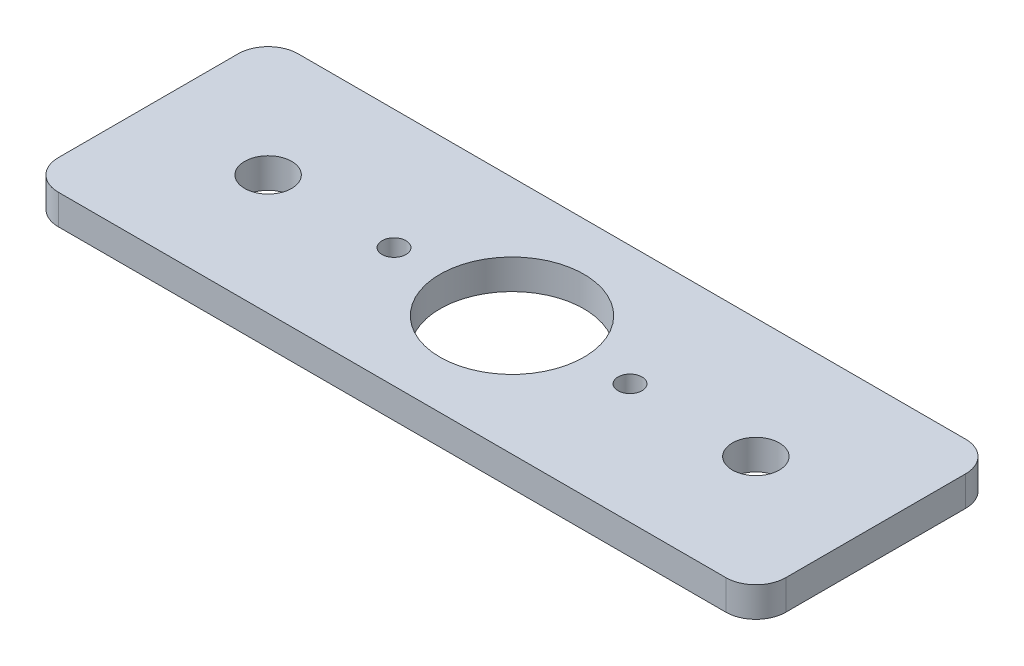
ISO-10303-21;
HEADER;
FILE_DESCRIPTION(('STEP AP214'),'2;1');
FILE_NAME('part.step','',(''),(''),'','','');
FILE_SCHEMA(('AUTOMOTIVE_DESIGN { 1 0 10303 214 1 1 1 1 }'));
ENDSEC;
DATA;
#1=APPLICATION_CONTEXT('core data for automotive mechanical design processes');
#2=APPLICATION_PROTOCOL_DEFINITION('international standard','automotive_design',2000,#1);
#3=PRODUCT_CONTEXT('',#1,'mechanical');
#4=PRODUCT('Part','Part','',(#3));
#5=PRODUCT_RELATED_PRODUCT_CATEGORY('part','',(#4));
#6=PRODUCT_DEFINITION_FORMATION('','',#4);
#7=PRODUCT_DEFINITION_CONTEXT('part definition',#1,'design');
#8=PRODUCT_DEFINITION('design','',#6,#7);
#9=PRODUCT_DEFINITION_SHAPE('','',#8);
#10=(LENGTH_UNIT() NAMED_UNIT(*) SI_UNIT(.MILLI.,.METRE.));
#11=(NAMED_UNIT(*) PLANE_ANGLE_UNIT() SI_UNIT($,.RADIAN.));
#12=(NAMED_UNIT(*) SI_UNIT($,.STERADIAN.) SOLID_ANGLE_UNIT());
#13=UNCERTAINTY_MEASURE_WITH_UNIT(LENGTH_MEASURE(1.E-05),#10,'distance_accuracy_value','');
#14=(GEOMETRIC_REPRESENTATION_CONTEXT(3) GLOBAL_UNCERTAINTY_ASSIGNED_CONTEXT((#13)) GLOBAL_UNIT_ASSIGNED_CONTEXT((#10,
#11,#12)) REPRESENTATION_CONTEXT('',''));
#15=CARTESIAN_POINT('',(0.,0.,0.));
#16=DIRECTION('',(0.,0.,1.));
#17=DIRECTION('',(1.,0.,0.));
#18=AXIS2_PLACEMENT_3D('',#15,#16,#17);
#19=CARTESIAN_POINT('',(0.,3.175,0.));
#20=DIRECTION('',(0.,-1.,0.));
#21=DIRECTION('',(0.,0.,-1.));
#22=AXIS2_PLACEMENT_3D('',#19,#20,#21);
#23=PLANE('',#22);
#24=DIRECTION('',(-1.,0.,0.));
#25=VECTOR('',#24,1.);
#26=CARTESIAN_POINT('',(0.,3.175,-25.4));
#27=LINE('',#26,#25);
#28=CARTESIAN_POINT('',(73.8886,3.175,-25.4));
#29=VERTEX_POINT('',#28);
#30=CARTESIAN_POINT('',(3.175,3.175,-25.4));
#31=VERTEX_POINT('',#30);
#32=EDGE_CURVE('E137',#29,#31,#27,.T.);
#33=ORIENTED_EDGE('',*,*,#32,.T.);
#34=CARTESIAN_POINT('',(3.175,3.175,-22.225));
#35=DIRECTION('',(0.,-1.,0.));
#36=DIRECTION('',(0.,0.,-1.));
#37=AXIS2_PLACEMENT_3D('',#34,#35,#36);
#38=CIRCLE('',#37,3.175);
#39=CARTESIAN_POINT('',(0.,3.175,-22.225));
#40=VERTEX_POINT('',#39);
#41=EDGE_CURVE('E156',#31,#40,#38,.F.);
#42=ORIENTED_EDGE('',*,*,#41,.T.);
#43=DIRECTION('',(0.,0.,1.));
#44=VECTOR('',#43,1.);
#45=CARTESIAN_POINT('',(0.,3.175,0.));
#46=LINE('',#45,#44);
#47=CARTESIAN_POINT('',(0.,3.175,-3.175));
#48=VERTEX_POINT('',#47);
#49=EDGE_CURVE('E120',#40,#48,#46,.T.);
#50=ORIENTED_EDGE('',*,*,#49,.T.);
#51=CARTESIAN_POINT('',(3.175,3.175,-3.175));
#52=DIRECTION('',(0.,-1.,0.));
#53=DIRECTION('',(0.,0.,-1.));
#54=AXIS2_PLACEMENT_3D('',#51,#52,#53);
#55=CIRCLE('',#54,3.175);
#56=CARTESIAN_POINT('',(3.175,3.175,0.));
#57=VERTEX_POINT('',#56);
#58=EDGE_CURVE('E151',#48,#57,#55,.F.);
#59=ORIENTED_EDGE('',*,*,#58,.T.);
#60=DIRECTION('',(1.,0.,0.));
#61=VECTOR('',#60,1.);
#62=CARTESIAN_POINT('',(0.,3.175,0.));
#63=LINE('',#62,#61);
#64=CARTESIAN_POINT('',(73.8886,3.175,0.));
#65=VERTEX_POINT('',#64);
#66=EDGE_CURVE('E167',#57,#65,#63,.T.);
#67=ORIENTED_EDGE('',*,*,#66,.T.);
#68=CARTESIAN_POINT('',(73.8886,3.175,-3.175));
#69=DIRECTION('',(0.,-1.,0.));
#70=DIRECTION('',(0.,0.,-1.));
#71=AXIS2_PLACEMENT_3D('',#68,#69,#70);
#72=CIRCLE('',#71,3.175);
#73=CARTESIAN_POINT('',(77.0636,3.175,-3.175));
#74=VERTEX_POINT('',#73);
#75=EDGE_CURVE('E56',#65,#74,#72,.F.);
#76=ORIENTED_EDGE('',*,*,#75,.T.);
#77=DIRECTION('',(0.,0.,-1.));
#78=VECTOR('',#77,1.);
#79=CARTESIAN_POINT('',(77.0636,3.175,0.));
#80=LINE('',#79,#78);
#81=CARTESIAN_POINT('',(77.0636,3.175,-22.225));
#82=VERTEX_POINT('',#81);
#83=EDGE_CURVE('E175',#74,#82,#80,.T.);
#84=ORIENTED_EDGE('',*,*,#83,.T.);
#85=CARTESIAN_POINT('',(73.8886,3.175,-22.225));
#86=DIRECTION('',(0.,-1.,0.));
#87=DIRECTION('',(0.,0.,-1.));
#88=AXIS2_PLACEMENT_3D('',#85,#86,#87);
#89=CIRCLE('',#88,3.175);
#90=EDGE_CURVE('E154',#82,#29,#89,.F.);
#91=ORIENTED_EDGE('',*,*,#90,.T.);
#92=EDGE_LOOP('',(#33,#42,#50,#59,#67,#76,#84,#91));
#93=FACE_BOUND('',#92,.T.);
#94=CARTESIAN_POINT('',(38.5318,3.175,-12.7));
#95=DIRECTION('',(0.,1.,0.));
#96=DIRECTION('',(0.,0.,1.));
#97=AXIS2_PLACEMENT_3D('',#94,#95,#96);
#98=CIRCLE('',#97,7.62);
#99=CARTESIAN_POINT('',(38.5318,3.175,-5.08));
#100=VERTEX_POINT('',#99);
#101=EDGE_CURVE('E128',#100,#100,#98,.T.);
#102=ORIENTED_EDGE('',*,*,#101,.F.);
#103=EDGE_LOOP('',(#102));
#104=FACE_BOUND('',#103,.T.);
#105=CARTESIAN_POINT('',(51.0318,3.175,-12.7));
#106=DIRECTION('',(0.,1.,0.));
#107=DIRECTION('',(0.,0.,1.));
#108=AXIS2_PLACEMENT_3D('',#105,#106,#107);
#109=CIRCLE('',#108,1.27);
#110=CARTESIAN_POINT('',(51.0318,3.175,-11.43));
#111=VERTEX_POINT('',#110);
#112=EDGE_CURVE('E182',#111,#111,#109,.T.);
#113=ORIENTED_EDGE('',*,*,#112,.F.);
#114=EDGE_LOOP('',(#113));
#115=FACE_BOUND('',#114,.T.);
#116=CARTESIAN_POINT('',(26.0318,3.175,-12.7));
#117=DIRECTION('',(0.,1.,0.));
#118=DIRECTION('',(0.,0.,1.));
#119=AXIS2_PLACEMENT_3D('',#116,#117,#118);
#120=CIRCLE('',#119,1.27);
#121=CARTESIAN_POINT('',(26.0318,3.175,-11.43));
#122=VERTEX_POINT('',#121);
#123=EDGE_CURVE('E187',#122,#122,#120,.T.);
#124=ORIENTED_EDGE('',*,*,#123,.F.);
#125=EDGE_LOOP('',(#124));
#126=FACE_BOUND('',#125,.T.);
#127=CARTESIAN_POINT('',(64.3636,3.175,-12.7));
#128=DIRECTION('',(0.,1.,0.));
#129=DIRECTION('',(0.,0.,1.));
#130=AXIS2_PLACEMENT_3D('',#127,#128,#129);
#131=CIRCLE('',#130,2.4892);
#132=CARTESIAN_POINT('',(64.3636,3.175,-10.2108));
#133=VERTEX_POINT('',#132);
#134=EDGE_CURVE('E193',#133,#133,#131,.T.);
#135=ORIENTED_EDGE('',*,*,#134,.F.);
#136=EDGE_LOOP('',(#135));
#137=FACE_BOUND('',#136,.T.);
#138=CARTESIAN_POINT('',(12.7,3.175,-12.7));
#139=DIRECTION('',(0.,1.,0.));
#140=DIRECTION('',(0.,0.,1.));
#141=AXIS2_PLACEMENT_3D('',#138,#139,#140);
#142=CIRCLE('',#141,2.4892);
#143=CARTESIAN_POINT('',(12.7,3.175,-10.2108));
#144=VERTEX_POINT('',#143);
#145=EDGE_CURVE('E199',#144,#144,#142,.T.);
#146=ORIENTED_EDGE('',*,*,#145,.F.);
#147=EDGE_LOOP('',(#146));
#148=FACE_BOUND('',#147,.T.);
#149=ADVANCED_FACE('F34',(#93,#104,#115,#126,#137,#148),#23,.F.);
#150=CARTESIAN_POINT('',(0.,0.,0.));
#151=DIRECTION('',(0.,-1.,0.));
#152=DIRECTION('',(0.,0.,-1.));
#153=AXIS2_PLACEMENT_3D('',#150,#151,#152);
#154=PLANE('',#153);
#155=CARTESIAN_POINT('',(64.3636,0.,-12.7));
#156=DIRECTION('',(0.,1.,0.));
#157=DIRECTION('',(0.,0.,1.));
#158=AXIS2_PLACEMENT_3D('',#155,#156,#157);
#159=CIRCLE('',#158,2.4892);
#160=CARTESIAN_POINT('',(64.3636,0.,-10.2108));
#161=VERTEX_POINT('',#160);
#162=EDGE_CURVE('E196',#161,#161,#159,.T.);
#163=ORIENTED_EDGE('',*,*,#162,.T.);
#164=EDGE_LOOP('',(#163));
#165=FACE_BOUND('',#164,.T.);
#166=CARTESIAN_POINT('',(51.0318,0.,-12.7));
#167=DIRECTION('',(0.,1.,0.));
#168=DIRECTION('',(0.,0.,1.));
#169=AXIS2_PLACEMENT_3D('',#166,#167,#168);
#170=CIRCLE('',#169,1.27);
#171=CARTESIAN_POINT('',(51.0318,0.,-11.43));
#172=VERTEX_POINT('',#171);
#173=EDGE_CURVE('E184',#172,#172,#170,.T.);
#174=ORIENTED_EDGE('',*,*,#173,.T.);
#175=EDGE_LOOP('',(#174));
#176=FACE_BOUND('',#175,.T.);
#177=DIRECTION('',(0.,0.,1.));
#178=VECTOR('',#177,1.);
#179=CARTESIAN_POINT('',(0.,0.,0.));
#180=LINE('',#179,#178);
#181=CARTESIAN_POINT('',(0.,0.,-22.225));
#182=VERTEX_POINT('',#181);
#183=CARTESIAN_POINT('',(0.,0.,-3.175));
#184=VERTEX_POINT('',#183);
#185=EDGE_CURVE('E117',#182,#184,#180,.T.);
#186=ORIENTED_EDGE('',*,*,#185,.F.);
#187=CARTESIAN_POINT('',(3.175,0.,-22.225));
#188=DIRECTION('',(0.,-1.,0.));
#189=DIRECTION('',(0.,0.,-1.));
#190=AXIS2_PLACEMENT_3D('',#187,#188,#189);
#191=CIRCLE('',#190,3.175);
#192=CARTESIAN_POINT('',(3.175,0.,-25.4));
#193=VERTEX_POINT('',#192);
#194=EDGE_CURVE('E100',#182,#193,#191,.T.);
#195=ORIENTED_EDGE('',*,*,#194,.T.);
#196=DIRECTION('',(-1.,0.,0.));
#197=VECTOR('',#196,1.);
#198=CARTESIAN_POINT('',(0.,0.,-25.4));
#199=LINE('',#198,#197);
#200=CARTESIAN_POINT('',(73.8886,0.,-25.4));
#201=VERTEX_POINT('',#200);
#202=EDGE_CURVE('E141',#201,#193,#199,.T.);
#203=ORIENTED_EDGE('',*,*,#202,.F.);
#204=CARTESIAN_POINT('',(73.8886,0.,-22.225));
#205=DIRECTION('',(0.,-1.,0.));
#206=DIRECTION('',(0.,0.,-1.));
#207=AXIS2_PLACEMENT_3D('',#204,#205,#206);
#208=CIRCLE('',#207,3.175);
#209=CARTESIAN_POINT('',(77.0636,0.,-22.225));
#210=VERTEX_POINT('',#209);
#211=EDGE_CURVE('E111',#201,#210,#208,.T.);
#212=ORIENTED_EDGE('',*,*,#211,.T.);
#213=DIRECTION('',(0.,0.,-1.));
#214=VECTOR('',#213,1.);
#215=CARTESIAN_POINT('',(77.0636,0.,0.));
#216=LINE('',#215,#214);
#217=CARTESIAN_POINT('',(77.0636,0.,-3.175));
#218=VERTEX_POINT('',#217);
#219=EDGE_CURVE('E131',#218,#210,#216,.T.);
#220=ORIENTED_EDGE('',*,*,#219,.F.);
#221=CARTESIAN_POINT('',(73.8886,0.,-3.175));
#222=DIRECTION('',(0.,-1.,0.));
#223=DIRECTION('',(0.,0.,-1.));
#224=AXIS2_PLACEMENT_3D('',#221,#222,#223);
#225=CIRCLE('',#224,3.175);
#226=CARTESIAN_POINT('',(73.8886,0.,0.));
#227=VERTEX_POINT('',#226);
#228=EDGE_CURVE('E145',#218,#227,#225,.T.);
#229=ORIENTED_EDGE('',*,*,#228,.T.);
#230=DIRECTION('',(1.,0.,0.));
#231=VECTOR('',#230,1.);
#232=CARTESIAN_POINT('',(0.,0.,0.));
#233=LINE('',#232,#231);
#234=CARTESIAN_POINT('',(3.175,0.,0.));
#235=VERTEX_POINT('',#234);
#236=EDGE_CURVE('E127',#235,#227,#233,.T.);
#237=ORIENTED_EDGE('',*,*,#236,.F.);
#238=CARTESIAN_POINT('',(3.175,0.,-3.175));
#239=DIRECTION('',(0.,-1.,0.));
#240=DIRECTION('',(0.,0.,-1.));
#241=AXIS2_PLACEMENT_3D('',#238,#239,#240);
#242=CIRCLE('',#241,3.175);
#243=EDGE_CURVE('E121',#235,#184,#242,.T.);
#244=ORIENTED_EDGE('',*,*,#243,.T.);
#245=EDGE_LOOP('',(#186,#195,#203,#212,#220,#229,#237,#244));
#246=FACE_BOUND('',#245,.T.);
#247=CARTESIAN_POINT('',(38.5318,0.,-12.7));
#248=DIRECTION('',(0.,1.,0.));
#249=DIRECTION('',(0.,0.,1.));
#250=AXIS2_PLACEMENT_3D('',#247,#248,#249);
#251=CIRCLE('',#250,7.62);
#252=CARTESIAN_POINT('',(38.5318,0.,-5.08));
#253=VERTEX_POINT('',#252);
#254=EDGE_CURVE('E134',#253,#253,#251,.T.);
#255=ORIENTED_EDGE('',*,*,#254,.T.);
#256=EDGE_LOOP('',(#255));
#257=FACE_BOUND('',#256,.T.);
#258=CARTESIAN_POINT('',(26.0318,0.,-12.7));
#259=DIRECTION('',(0.,1.,0.));
#260=DIRECTION('',(0.,0.,1.));
#261=AXIS2_PLACEMENT_3D('',#258,#259,#260);
#262=CIRCLE('',#261,1.27);
#263=CARTESIAN_POINT('',(26.0318,0.,-11.43));
#264=VERTEX_POINT('',#263);
#265=EDGE_CURVE('E190',#264,#264,#262,.T.);
#266=ORIENTED_EDGE('',*,*,#265,.T.);
#267=EDGE_LOOP('',(#266));
#268=FACE_BOUND('',#267,.T.);
#269=CARTESIAN_POINT('',(12.7,0.,-12.7));
#270=DIRECTION('',(0.,1.,0.));
#271=DIRECTION('',(0.,0.,1.));
#272=AXIS2_PLACEMENT_3D('',#269,#270,#271);
#273=CIRCLE('',#272,2.4892);
#274=CARTESIAN_POINT('',(12.7,0.,-10.2108));
#275=VERTEX_POINT('',#274);
#276=EDGE_CURVE('E202',#275,#275,#273,.T.);
#277=ORIENTED_EDGE('',*,*,#276,.T.);
#278=EDGE_LOOP('',(#277));
#279=FACE_BOUND('',#278,.T.);
#280=ADVANCED_FACE('F124',(#165,#176,#246,#257,#268,#279),#154,.T.);
#281=CARTESIAN_POINT('',(0.,3.175,0.));
#282=DIRECTION('',(1.,0.,0.));
#283=DIRECTION('',(0.,0.,-1.));
#284=AXIS2_PLACEMENT_3D('',#281,#282,#283);
#285=PLANE('',#284);
#286=ORIENTED_EDGE('',*,*,#49,.F.);
#287=DIRECTION('',(0.,-1.,0.));
#288=VECTOR('',#287,1.);
#289=CARTESIAN_POINT('',(0.,3.175,-22.225));
#290=LINE('',#289,#288);
#291=EDGE_CURVE('E104',#40,#182,#290,.T.);
#292=ORIENTED_EDGE('',*,*,#291,.T.);
#293=ORIENTED_EDGE('',*,*,#185,.T.);
#294=DIRECTION('',(0.,-1.,0.));
#295=VECTOR('',#294,1.);
#296=CARTESIAN_POINT('',(0.,3.175,-3.175));
#297=LINE('',#296,#295);
#298=EDGE_CURVE('E122',#184,#48,#297,.F.);
#299=ORIENTED_EDGE('',*,*,#298,.T.);
#300=EDGE_LOOP('',(#286,#292,#293,#299));
#301=FACE_BOUND('',#300,.T.);
#302=ADVANCED_FACE('F116',(#301),#285,.F.);
#303=CARTESIAN_POINT('',(0.,3.175,0.));
#304=DIRECTION('',(0.,0.,-1.));
#305=DIRECTION('',(-1.,0.,0.));
#306=AXIS2_PLACEMENT_3D('',#303,#304,#305);
#307=PLANE('',#306);
#308=ORIENTED_EDGE('',*,*,#236,.T.);
#309=DIRECTION('',(0.,-1.,0.));
#310=VECTOR('',#309,1.);
#311=CARTESIAN_POINT('',(73.8886,3.175,0.));
#312=LINE('',#311,#310);
#313=EDGE_CURVE('E11',#227,#65,#312,.F.);
#314=ORIENTED_EDGE('',*,*,#313,.T.);
#315=ORIENTED_EDGE('',*,*,#66,.F.);
#316=DIRECTION('',(0.,-1.,0.));
#317=VECTOR('',#316,1.);
#318=CARTESIAN_POINT('',(3.175,3.175,0.));
#319=LINE('',#318,#317);
#320=EDGE_CURVE('E42',#57,#235,#319,.T.);
#321=ORIENTED_EDGE('',*,*,#320,.T.);
#322=EDGE_LOOP('',(#308,#314,#315,#321));
#323=FACE_BOUND('',#322,.T.);
#324=ADVANCED_FACE('F165',(#323),#307,.F.);
#325=CARTESIAN_POINT('',(77.0636,3.175,0.));
#326=DIRECTION('',(-1.,0.,0.));
#327=DIRECTION('',(0.,0.,1.));
#328=AXIS2_PLACEMENT_3D('',#325,#326,#327);
#329=PLANE('',#328);
#330=ORIENTED_EDGE('',*,*,#219,.T.);
#331=DIRECTION('',(0.,-1.,0.));
#332=VECTOR('',#331,1.);
#333=CARTESIAN_POINT('',(77.0636,3.175,-22.225));
#334=LINE('',#333,#332);
#335=EDGE_CURVE('E49',#210,#82,#334,.F.);
#336=ORIENTED_EDGE('',*,*,#335,.T.);
#337=ORIENTED_EDGE('',*,*,#83,.F.);
#338=DIRECTION('',(0.,-1.,0.));
#339=VECTOR('',#338,1.);
#340=CARTESIAN_POINT('',(77.0636,3.175,-3.175));
#341=LINE('',#340,#339);
#342=EDGE_CURVE('E158',#74,#218,#341,.T.);
#343=ORIENTED_EDGE('',*,*,#342,.T.);
#344=EDGE_LOOP('',(#330,#336,#337,#343));
#345=FACE_BOUND('',#344,.T.);
#346=ADVANCED_FACE('F174',(#345),#329,.F.);
#347=CARTESIAN_POINT('',(0.,3.175,-25.4));
#348=DIRECTION('',(0.,0.,1.));
#349=DIRECTION('',(1.,0.,0.));
#350=AXIS2_PLACEMENT_3D('',#347,#348,#349);
#351=PLANE('',#350);
#352=ORIENTED_EDGE('',*,*,#202,.T.);
#353=DIRECTION('',(0.,-1.,0.));
#354=VECTOR('',#353,1.);
#355=CARTESIAN_POINT('',(3.175,3.175,-25.4));
#356=LINE('',#355,#354);
#357=EDGE_CURVE('E105',#193,#31,#356,.F.);
#358=ORIENTED_EDGE('',*,*,#357,.T.);
#359=ORIENTED_EDGE('',*,*,#32,.F.);
#360=DIRECTION('',(0.,-1.,0.));
#361=VECTOR('',#360,1.);
#362=CARTESIAN_POINT('',(73.8886,3.175,-25.4));
#363=LINE('',#362,#361);
#364=EDGE_CURVE('E110',#29,#201,#363,.T.);
#365=ORIENTED_EDGE('',*,*,#364,.T.);
#366=EDGE_LOOP('',(#352,#358,#359,#365));
#367=FACE_BOUND('',#366,.T.);
#368=ADVANCED_FACE('F223',(#367),#351,.F.);
#369=CARTESIAN_POINT('',(38.5318,3.175,-12.7));
#370=DIRECTION('',(0.,-1.,0.));
#371=DIRECTION('',(0.,0.,-1.));
#372=AXIS2_PLACEMENT_3D('',#369,#370,#371);
#373=CYLINDRICAL_SURFACE('',#372,7.62);
#374=ORIENTED_EDGE('',*,*,#101,.T.);
#375=EDGE_LOOP('',(#374));
#376=FACE_BOUND('',#375,.T.);
#377=ORIENTED_EDGE('',*,*,#254,.F.);
#378=EDGE_LOOP('',(#377));
#379=FACE_BOUND('',#378,.T.);
#380=ADVANCED_FACE('F220',(#376,#379),#373,.F.);
#381=CARTESIAN_POINT('',(51.0318,3.175,-12.7));
#382=DIRECTION('',(0.,-1.,0.));
#383=DIRECTION('',(0.,0.,-1.));
#384=AXIS2_PLACEMENT_3D('',#381,#382,#383);
#385=CYLINDRICAL_SURFACE('',#384,1.27);
#386=ORIENTED_EDGE('',*,*,#112,.T.);
#387=EDGE_LOOP('',(#386));
#388=FACE_BOUND('',#387,.T.);
#389=ORIENTED_EDGE('',*,*,#173,.F.);
#390=EDGE_LOOP('',(#389));
#391=FACE_BOUND('',#390,.T.);
#392=ADVANCED_FACE('F326',(#388,#391),#385,.F.);
#393=CARTESIAN_POINT('',(26.0318,3.175,-12.7));
#394=DIRECTION('',(0.,-1.,0.));
#395=DIRECTION('',(0.,0.,-1.));
#396=AXIS2_PLACEMENT_3D('',#393,#394,#395);
#397=CYLINDRICAL_SURFACE('',#396,1.27);
#398=ORIENTED_EDGE('',*,*,#123,.T.);
#399=EDGE_LOOP('',(#398));
#400=FACE_BOUND('',#399,.T.);
#401=ORIENTED_EDGE('',*,*,#265,.F.);
#402=EDGE_LOOP('',(#401));
#403=FACE_BOUND('',#402,.T.);
#404=ADVANCED_FACE('F316',(#400,#403),#397,.F.);
#405=CARTESIAN_POINT('',(64.3636,3.175,-12.7));
#406=DIRECTION('',(0.,-1.,0.));
#407=DIRECTION('',(0.,0.,-1.));
#408=AXIS2_PLACEMENT_3D('',#405,#406,#407);
#409=CYLINDRICAL_SURFACE('',#408,2.4892);
#410=ORIENTED_EDGE('',*,*,#134,.T.);
#411=EDGE_LOOP('',(#410));
#412=FACE_BOUND('',#411,.T.);
#413=ORIENTED_EDGE('',*,*,#162,.F.);
#414=EDGE_LOOP('',(#413));
#415=FACE_BOUND('',#414,.T.);
#416=ADVANCED_FACE('F307',(#412,#415),#409,.F.);
#417=CARTESIAN_POINT('',(12.7,3.175,-12.7));
#418=DIRECTION('',(0.,-1.,0.));
#419=DIRECTION('',(0.,0.,-1.));
#420=AXIS2_PLACEMENT_3D('',#417,#418,#419);
#421=CYLINDRICAL_SURFACE('',#420,2.4892);
#422=ORIENTED_EDGE('',*,*,#145,.T.);
#423=EDGE_LOOP('',(#422));
#424=FACE_BOUND('',#423,.T.);
#425=ORIENTED_EDGE('',*,*,#276,.F.);
#426=EDGE_LOOP('',(#425));
#427=FACE_BOUND('',#426,.T.);
#428=ADVANCED_FACE('F208',(#424,#427),#421,.F.);
#429=CARTESIAN_POINT('',(3.175,3.175,-22.225));
#430=DIRECTION('',(0.,-1.,0.));
#431=DIRECTION('',(0.,0.,-1.));
#432=AXIS2_PLACEMENT_3D('',#429,#430,#431);
#433=CYLINDRICAL_SURFACE('',#432,3.175);
#434=ORIENTED_EDGE('',*,*,#41,.F.);
#435=ORIENTED_EDGE('',*,*,#357,.F.);
#436=ORIENTED_EDGE('',*,*,#194,.F.);
#437=ORIENTED_EDGE('',*,*,#291,.F.);
#438=EDGE_LOOP('',(#434,#435,#436,#437));
#439=FACE_BOUND('',#438,.T.);
#440=ADVANCED_FACE('F103',(#439),#433,.T.);
#441=CARTESIAN_POINT('',(73.8886,3.175,-22.225));
#442=DIRECTION('',(0.,-1.,0.));
#443=DIRECTION('',(0.,0.,-1.));
#444=AXIS2_PLACEMENT_3D('',#441,#442,#443);
#445=CYLINDRICAL_SURFACE('',#444,3.175);
#446=ORIENTED_EDGE('',*,*,#90,.F.);
#447=ORIENTED_EDGE('',*,*,#335,.F.);
#448=ORIENTED_EDGE('',*,*,#211,.F.);
#449=ORIENTED_EDGE('',*,*,#364,.F.);
#450=EDGE_LOOP('',(#446,#447,#448,#449));
#451=FACE_BOUND('',#450,.T.);
#452=ADVANCED_FACE('F235',(#451),#445,.T.);
#453=CARTESIAN_POINT('',(73.8886,3.175,-3.175));
#454=DIRECTION('',(0.,-1.,0.));
#455=DIRECTION('',(0.,0.,-1.));
#456=AXIS2_PLACEMENT_3D('',#453,#454,#455);
#457=CYLINDRICAL_SURFACE('',#456,3.175);
#458=ORIENTED_EDGE('',*,*,#75,.F.);
#459=ORIENTED_EDGE('',*,*,#313,.F.);
#460=ORIENTED_EDGE('',*,*,#228,.F.);
#461=ORIENTED_EDGE('',*,*,#342,.F.);
#462=EDGE_LOOP('',(#458,#459,#460,#461));
#463=FACE_BOUND('',#462,.T.);
#464=ADVANCED_FACE('F173',(#463),#457,.T.);
#465=CARTESIAN_POINT('',(3.175,3.175,-3.175));
#466=DIRECTION('',(0.,-1.,0.));
#467=DIRECTION('',(0.,0.,-1.));
#468=AXIS2_PLACEMENT_3D('',#465,#466,#467);
#469=CYLINDRICAL_SURFACE('',#468,3.175);
#470=ORIENTED_EDGE('',*,*,#58,.F.);
#471=ORIENTED_EDGE('',*,*,#298,.F.);
#472=ORIENTED_EDGE('',*,*,#243,.F.);
#473=ORIENTED_EDGE('',*,*,#320,.F.);
#474=EDGE_LOOP('',(#470,#471,#472,#473));
#475=FACE_BOUND('',#474,.T.);
#476=ADVANCED_FACE('F36',(#475),#469,.T.);
#477=CLOSED_SHELL('',(#149,#280,#302,#324,#346,#368,#380,#392,#404,#416,#428,#440,#452,#464,#476));
#478=MANIFOLD_SOLID_BREP('B2',#477);
#479=ADVANCED_BREP_SHAPE_REPRESENTATION('',(#18,#478),#14);
#480=SHAPE_DEFINITION_REPRESENTATION(#9,#479);
ENDSEC;
END-ISO-10303-21;
